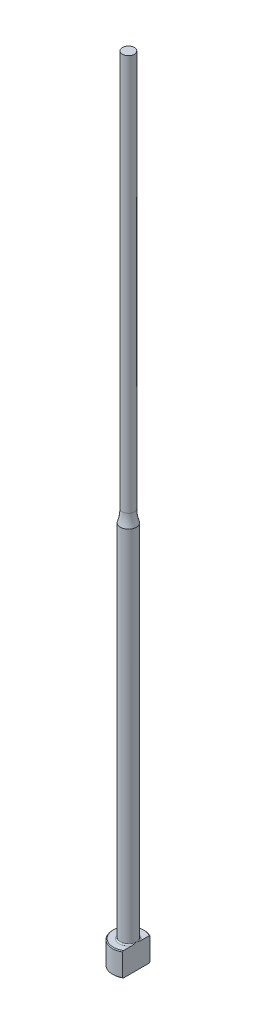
from build123d import *
from build123d.topology import SkipClean

# Parameters (mm, degrees)
CHAMFER1_SIZE    = 0.2
FILLET1_R        = 0.3
KEYED_HEAD_DEPTH = 201.079984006


with BuildPart() as part:
    # Sketch1 → Revolve1 (revolve)
    with BuildSketch(Plane.XY, mode=Mode.PRIVATE) as revolve1_sk:
        with BuildLine():
            Line((0, 0), (-4, 0))
            Line((-4, 0), (-4, 6))
            Line((-4, 6), (-2, 6))
            Line((-2, 6), (-2, 96.877501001))
            ThreePointArc((-2, 96.877501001), (-1.625791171, 98.41886117), (-1.5, 100))
            Line((-1.5, 100), (-1.5, 200))
            Line((-1.5, 200), (0, 200))
            Line((0, 200), (0, 0))
        make_face()
    revolve(revolve1_sk.sketch.rotate(Axis((0, 259.958771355, 0), (0, -1, 0)), 270), axis=Axis((0, 259.958771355, 0), (0, -1, 0)))

    # Chamfer1
    chamfer1_edges = [part.edges().sort_by_distance(p)[0] for p in [
        (0, 0, -4),
        (0, 6, -4),
    ]]
    chamfer(chamfer1_edges, length=CHAMFER1_SIZE)

    # Fillet1
    fillet1_edges = [part.edges().sort_by_distance(p)[0] for p in [
        (0, 6, -2),
    ]]
    fillet(fillet1_edges, radius=FILLET1_R)

    # Sketch2 → Keyed Head (cut, through all)
    with SkipClean():  # the faces are left unmerged after this step: merging them gives an invalid solid
        with BuildSketch(Plane(origin=(0, 0, 0), x_dir=(1, 0, 0), z_dir=(0, 1, 0))):
            with BuildLine():
                Line((2, -3.464101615), (2, 3.464101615))
                ThreePointArc((2, 3.464101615), (4, 0), (2, -3.464101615))
            make_face()
        extrude(amount=KEYED_HEAD_DEPTH, mode=Mode.SUBTRACT)


solid = part.part
